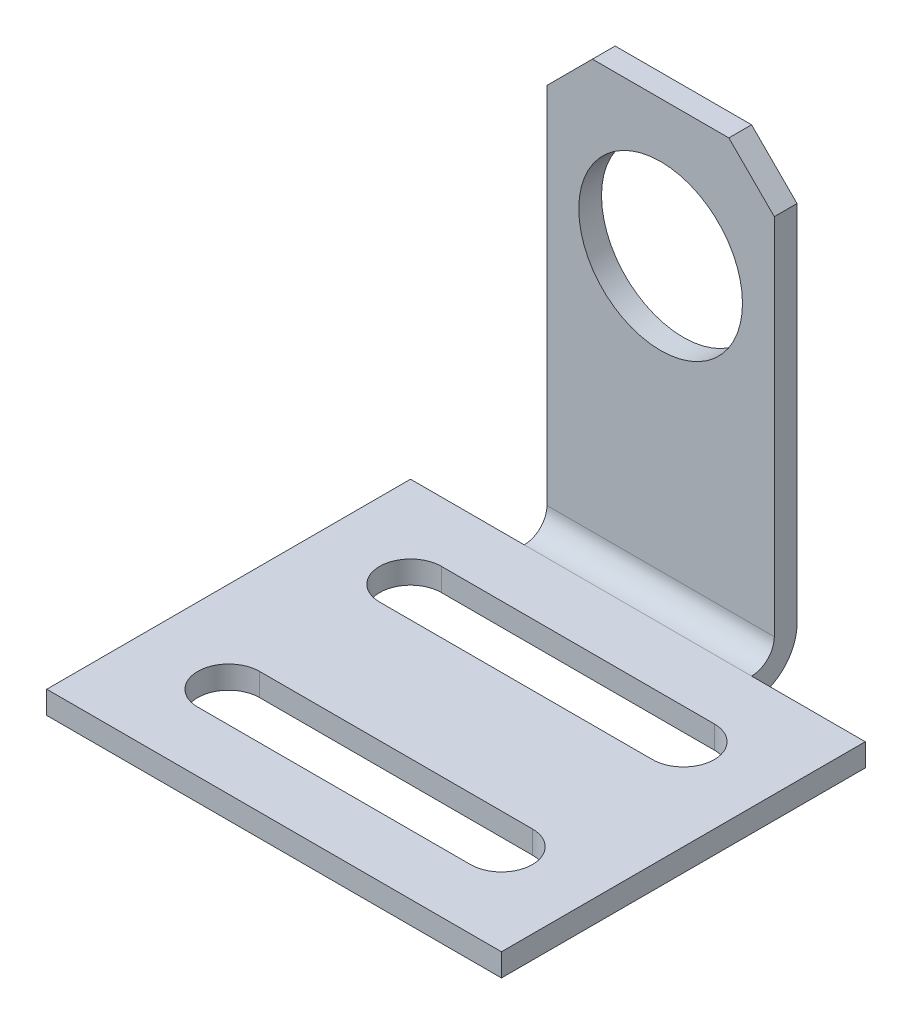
ISO-10303-21;
HEADER;
FILE_DESCRIPTION(('STEP AP214'),'2;1');
FILE_NAME('part.step','',(''),(''),'','','');
FILE_SCHEMA(('AUTOMOTIVE_DESIGN { 1 0 10303 214 1 1 1 1 }'));
ENDSEC;
DATA;
#1=APPLICATION_CONTEXT('core data for automotive mechanical design processes');
#2=APPLICATION_PROTOCOL_DEFINITION('international standard','automotive_design',2000,#1);
#3=PRODUCT_CONTEXT('',#1,'mechanical');
#4=PRODUCT('Part','Part','',(#3));
#5=PRODUCT_RELATED_PRODUCT_CATEGORY('part','',(#4));
#6=PRODUCT_DEFINITION_FORMATION('','',#4);
#7=PRODUCT_DEFINITION_CONTEXT('part definition',#1,'design');
#8=PRODUCT_DEFINITION('design','',#6,#7);
#9=PRODUCT_DEFINITION_SHAPE('','',#8);
#10=(LENGTH_UNIT() NAMED_UNIT(*) SI_UNIT(.MILLI.,.METRE.));
#11=(NAMED_UNIT(*) PLANE_ANGLE_UNIT() SI_UNIT($,.RADIAN.));
#12=(NAMED_UNIT(*) SI_UNIT($,.STERADIAN.) SOLID_ANGLE_UNIT());
#13=UNCERTAINTY_MEASURE_WITH_UNIT(LENGTH_MEASURE(1.E-05),#10,'distance_accuracy_value','');
#14=(GEOMETRIC_REPRESENTATION_CONTEXT(3) GLOBAL_UNCERTAINTY_ASSIGNED_CONTEXT((#13)) GLOBAL_UNIT_ASSIGNED_CONTEXT((#10,
#11,#12)) REPRESENTATION_CONTEXT('',''));
#15=CARTESIAN_POINT('',(0.,0.,0.));
#16=DIRECTION('',(0.,0.,1.));
#17=DIRECTION('',(1.,0.,0.));
#18=AXIS2_PLACEMENT_3D('',#15,#16,#17);
#19=CARTESIAN_POINT('',(25.,5.,-42.5));
#20=DIRECTION('',(1.,0.,0.));
#21=DIRECTION('',(0.,0.,-1.));
#22=AXIS2_PLACEMENT_3D('',#19,#20,#21);
#23=PLANE('',#22);
#24=DIRECTION('',(0.,0.,-1.));
#25=VECTOR('',#24,1.);
#26=CARTESIAN_POINT('',(25.,0.,-1.66533453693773E-13));
#27=LINE('',#26,#25);
#28=CARTESIAN_POINT('',(25.,0.,-1.66533453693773E-13));
#29=VERTEX_POINT('',#28);
#30=CARTESIAN_POINT('',(25.,0.,-40.));
#31=VERTEX_POINT('',#30);
#32=EDGE_CURVE('E413',#29,#31,#27,.T.);
#33=ORIENTED_EDGE('',*,*,#32,.T.);
#34=DIRECTION('',(0.,1.,0.));
#35=VECTOR('',#34,1.);
#36=CARTESIAN_POINT('',(25.,0.,-40.));
#37=LINE('',#36,#35);
#38=CARTESIAN_POINT('',(25.,2.50000000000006,-40.));
#39=VERTEX_POINT('',#38);
#40=EDGE_CURVE('E228',#31,#39,#37,.T.);
#41=ORIENTED_EDGE('',*,*,#40,.T.);
#42=DIRECTION('',(0.,0.,-1.));
#43=VECTOR('',#42,1.);
#44=CARTESIAN_POINT('',(25.,2.49999999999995,-1.66533453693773E-13));
#45=LINE('',#44,#43);
#46=CARTESIAN_POINT('',(25.,2.49999999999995,-1.66533453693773E-13));
#47=VERTEX_POINT('',#46);
#48=EDGE_CURVE('E404',#47,#39,#45,.T.);
#49=ORIENTED_EDGE('',*,*,#48,.F.);
#50=DIRECTION('',(0.,1.,0.));
#51=VECTOR('',#50,1.);
#52=CARTESIAN_POINT('',(25.,0.,-1.66533453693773E-13));
#53=LINE('',#52,#51);
#54=EDGE_CURVE('E411',#29,#47,#53,.T.);
#55=ORIENTED_EDGE('',*,*,#54,.F.);
#56=EDGE_LOOP('',(#33,#41,#49,#55));
#57=FACE_BOUND('',#56,.T.);
#58=ADVANCED_FACE('F44',(#57),#23,.T.);
#59=CARTESIAN_POINT('',(-25.,0.,-45.));
#60=DIRECTION('',(0.,0.,-1.));
#61=DIRECTION('',(-1.,0.,0.));
#62=AXIS2_PLACEMENT_3D('',#59,#60,#61);
#63=PLANE('',#62);
#64=DIRECTION('',(1.,0.,0.));
#65=VECTOR('',#64,1.);
#66=CARTESIAN_POINT('',(-25.,50.,-45.));
#67=LINE('',#66,#65);
#68=CARTESIAN_POINT('',(-7.49999999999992,50.,-45.));
#69=VERTEX_POINT('',#68);
#70=CARTESIAN_POINT('',(7.50000000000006,50.,-45.));
#71=VERTEX_POINT('',#70);
#72=EDGE_CURVE('E248',#69,#71,#67,.T.);
#73=ORIENTED_EDGE('',*,*,#72,.T.);
#74=DIRECTION('',(-0.707106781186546,0.707106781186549,0.));
#75=VECTOR('',#74,1.);
#76=CARTESIAN_POINT('',(16.25,41.2499999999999,-45.));
#77=LINE('',#76,#75);
#78=CARTESIAN_POINT('',(12.5,45.,-45.));
#79=VERTEX_POINT('',#78);
#80=EDGE_CURVE('E300',#71,#79,#77,.F.);
#81=ORIENTED_EDGE('',*,*,#80,.T.);
#82=DIRECTION('',(0.,1.,0.));
#83=VECTOR('',#82,1.);
#84=CARTESIAN_POINT('',(12.5000000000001,50.,-45.));
#85=LINE('',#84,#83);
#86=CARTESIAN_POINT('',(12.5,5.,-45.));
#87=VERTEX_POINT('',#86);
#88=EDGE_CURVE('E194',#87,#79,#85,.T.);
#89=ORIENTED_EDGE('',*,*,#88,.F.);
#90=DIRECTION('',(1.,0.,0.));
#91=VECTOR('',#90,1.);
#92=CARTESIAN_POINT('',(-25.,5.,-45.));
#93=LINE('',#92,#91);
#94=CARTESIAN_POINT('',(-12.5,5.,-45.));
#95=VERTEX_POINT('',#94);
#96=EDGE_CURVE('E224',#95,#87,#93,.T.);
#97=ORIENTED_EDGE('',*,*,#96,.F.);
#98=DIRECTION('',(0.,-1.,0.));
#99=VECTOR('',#98,1.);
#100=CARTESIAN_POINT('',(-12.5,0.,-45.));
#101=LINE('',#100,#99);
#102=CARTESIAN_POINT('',(-12.5,44.9999999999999,-45.));
#103=VERTEX_POINT('',#102);
#104=EDGE_CURVE('E189',#103,#95,#101,.T.);
#105=ORIENTED_EDGE('',*,*,#104,.F.);
#106=DIRECTION('',(-0.707106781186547,-0.707106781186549,0.));
#107=VECTOR('',#106,1.);
#108=CARTESIAN_POINT('',(-41.25,16.2499999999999,-45.));
#109=LINE('',#108,#107);
#110=EDGE_CURVE('E297',#103,#69,#109,.F.);
#111=ORIENTED_EDGE('',*,*,#110,.T.);
#112=EDGE_LOOP('',(#73,#81,#89,#97,#105,#111));
#113=FACE_BOUND('',#112,.T.);
#114=CARTESIAN_POINT('',(0.,35.,-45.));
#115=DIRECTION('',(0.,0.,-1.));
#116=DIRECTION('',(-1.,0.,0.));
#117=AXIS2_PLACEMENT_3D('',#114,#115,#116);
#118=CIRCLE('',#117,9.);
#119=CARTESIAN_POINT('',(-9.,35.,-45.));
#120=VERTEX_POINT('',#119);
#121=EDGE_CURVE('E390',#120,#120,#118,.F.);
#122=ORIENTED_EDGE('',*,*,#121,.T.);
#123=EDGE_LOOP('',(#122));
#124=FACE_BOUND('',#123,.T.);
#125=ADVANCED_FACE('F320',(#113,#124),#63,.T.);
#126=CARTESIAN_POINT('',(-25.,5.,-40.));
#127=DIRECTION('',(1.,0.,0.));
#128=DIRECTION('',(0.,0.,-1.));
#129=AXIS2_PLACEMENT_3D('',#126,#127,#128);
#130=CYLINDRICAL_SURFACE('',#129,5.);
#131=CARTESIAN_POINT('',(-12.5,5.,-40.));
#132=DIRECTION('',(1.,0.,0.));
#133=DIRECTION('',(0.,0.,-1.));
#134=AXIS2_PLACEMENT_3D('',#131,#132,#133);
#135=CIRCLE('',#134,5.);
#136=CARTESIAN_POINT('',(-12.5,0.,-40.));
#137=VERTEX_POINT('',#136);
#138=EDGE_CURVE('E182',#95,#137,#135,.F.);
#139=ORIENTED_EDGE('',*,*,#138,.F.);
#140=ORIENTED_EDGE('',*,*,#96,.T.);
#141=CARTESIAN_POINT('',(12.5,5.,-40.));
#142=DIRECTION('',(-1.,0.,0.));
#143=DIRECTION('',(0.,0.,1.));
#144=AXIS2_PLACEMENT_3D('',#141,#142,#143);
#145=CIRCLE('',#144,5.);
#146=CARTESIAN_POINT('',(12.5,0.,-40.));
#147=VERTEX_POINT('',#146);
#148=EDGE_CURVE('E211',#147,#87,#145,.F.);
#149=ORIENTED_EDGE('',*,*,#148,.F.);
#150=DIRECTION('',(1.,0.,0.));
#151=VECTOR('',#150,1.);
#152=CARTESIAN_POINT('',(-25.,0.,-40.));
#153=LINE('',#152,#151);
#154=EDGE_CURVE('E208',#137,#147,#153,.T.);
#155=ORIENTED_EDGE('',*,*,#154,.F.);
#156=EDGE_LOOP('',(#139,#140,#149,#155));
#157=FACE_BOUND('',#156,.T.);
#158=ADVANCED_FACE('F209',(#157),#130,.T.);
#159=CARTESIAN_POINT('',(-25.,0.,0.));
#160=DIRECTION('',(0.,-1.,0.));
#161=DIRECTION('',(0.,0.,-1.));
#162=AXIS2_PLACEMENT_3D('',#159,#160,#161);
#163=PLANE('',#162);
#164=CARTESIAN_POINT('',(15.,0.,-30.));
#165=DIRECTION('',(0.,-1.,0.));
#166=DIRECTION('',(0.,0.,1.));
#167=AXIS2_PLACEMENT_3D('',#164,#165,#166);
#168=CIRCLE('',#167,3.4);
#169=CARTESIAN_POINT('',(15.,0.,-33.4));
#170=VERTEX_POINT('',#169);
#171=CARTESIAN_POINT('',(15.,0.,-26.6));
#172=VERTEX_POINT('',#171);
#173=EDGE_CURVE('E344',#170,#172,#168,.T.);
#174=ORIENTED_EDGE('',*,*,#173,.F.);
#175=DIRECTION('',(1.,0.,0.));
#176=VECTOR('',#175,1.);
#177=CARTESIAN_POINT('',(15.,0.,-33.4));
#178=LINE('',#177,#176);
#179=CARTESIAN_POINT('',(-15.,0.,-33.4));
#180=VERTEX_POINT('',#179);
#181=EDGE_CURVE('E355',#180,#170,#178,.T.);
#182=ORIENTED_EDGE('',*,*,#181,.F.);
#183=CARTESIAN_POINT('',(-15.,0.,-30.0000000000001));
#184=DIRECTION('',(0.,-1.,0.));
#185=DIRECTION('',(0.,0.,-1.));
#186=AXIS2_PLACEMENT_3D('',#183,#184,#185);
#187=CIRCLE('',#186,3.4);
#188=CARTESIAN_POINT('',(-15.,0.,-26.6));
#189=VERTEX_POINT('',#188);
#190=EDGE_CURVE('E351',#189,#180,#187,.T.);
#191=ORIENTED_EDGE('',*,*,#190,.F.);
#192=DIRECTION('',(-1.,0.,0.));
#193=VECTOR('',#192,1.);
#194=CARTESIAN_POINT('',(15.,0.,-26.6));
#195=LINE('',#194,#193);
#196=EDGE_CURVE('E347',#172,#189,#195,.T.);
#197=ORIENTED_EDGE('',*,*,#196,.F.);
#198=EDGE_LOOP('',(#174,#182,#191,#197));
#199=FACE_BOUND('',#198,.T.);
#200=CARTESIAN_POINT('',(15.,0.,-10.0000000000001));
#201=DIRECTION('',(0.,-1.,0.));
#202=DIRECTION('',(0.,0.,1.));
#203=AXIS2_PLACEMENT_3D('',#200,#201,#202);
#204=CIRCLE('',#203,3.4);
#205=CARTESIAN_POINT('',(15.,0.,-13.4));
#206=VERTEX_POINT('',#205);
#207=CARTESIAN_POINT('',(15.,0.,-6.59999999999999));
#208=VERTEX_POINT('',#207);
#209=EDGE_CURVE('E363',#206,#208,#204,.T.);
#210=ORIENTED_EDGE('',*,*,#209,.F.);
#211=DIRECTION('',(1.,0.,0.));
#212=VECTOR('',#211,1.);
#213=CARTESIAN_POINT('',(15.,0.,-13.4));
#214=LINE('',#213,#212);
#215=CARTESIAN_POINT('',(-15.,0.,-13.4));
#216=VERTEX_POINT('',#215);
#217=EDGE_CURVE('E382',#216,#206,#214,.T.);
#218=ORIENTED_EDGE('',*,*,#217,.F.);
#219=CARTESIAN_POINT('',(-15.,0.,-10.0000000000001));
#220=DIRECTION('',(0.,-1.,0.));
#221=DIRECTION('',(0.,0.,-1.));
#222=AXIS2_PLACEMENT_3D('',#219,#220,#221);
#223=CIRCLE('',#222,3.4);
#224=CARTESIAN_POINT('',(-15.,0.,-6.59999999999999));
#225=VERTEX_POINT('',#224);
#226=EDGE_CURVE('E378',#225,#216,#223,.T.);
#227=ORIENTED_EDGE('',*,*,#226,.F.);
#228=DIRECTION('',(-1.,0.,0.));
#229=VECTOR('',#228,1.);
#230=CARTESIAN_POINT('',(15.,0.,-6.59999999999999));
#231=LINE('',#230,#229);
#232=EDGE_CURVE('E374',#208,#225,#231,.T.);
#233=ORIENTED_EDGE('',*,*,#232,.F.);
#234=EDGE_LOOP('',(#210,#218,#227,#233));
#235=FACE_BOUND('',#234,.T.);
#236=ORIENTED_EDGE('',*,*,#32,.F.);
#237=DIRECTION('',(1.,0.,0.));
#238=VECTOR('',#237,1.);
#239=CARTESIAN_POINT('',(-25.,0.,0.));
#240=LINE('',#239,#238);
#241=CARTESIAN_POINT('',(-25.,0.,0.));
#242=VERTEX_POINT('',#241);
#243=EDGE_CURVE('E216',#242,#29,#240,.T.);
#244=ORIENTED_EDGE('',*,*,#243,.F.);
#245=DIRECTION('',(0.,0.,-1.));
#246=VECTOR('',#245,1.);
#247=CARTESIAN_POINT('',(-25.,0.,0.));
#248=LINE('',#247,#246);
#249=CARTESIAN_POINT('',(-25.,0.,-40.));
#250=VERTEX_POINT('',#249);
#251=EDGE_CURVE('E222',#242,#250,#248,.T.);
#252=ORIENTED_EDGE('',*,*,#251,.T.);
#253=EDGE_CURVE('E200',#250,#137,#153,.T.);
#254=ORIENTED_EDGE('',*,*,#253,.T.);
#255=ORIENTED_EDGE('',*,*,#154,.T.);
#256=DIRECTION('',(-1.,0.,0.));
#257=VECTOR('',#256,1.);
#258=CARTESIAN_POINT('',(25.,0.,-40.));
#259=LINE('',#258,#257);
#260=EDGE_CURVE('E324',#31,#147,#259,.T.);
#261=ORIENTED_EDGE('',*,*,#260,.F.);
#262=EDGE_LOOP('',(#236,#244,#252,#254,#255,#261));
#263=FACE_BOUND('',#262,.T.);
#264=ADVANCED_FACE('F220',(#199,#235,#263),#163,.T.);
#265=CARTESIAN_POINT('',(-25.,0.,0.));
#266=DIRECTION('',(0.,0.,-1.));
#267=DIRECTION('',(-1.,0.,0.));
#268=AXIS2_PLACEMENT_3D('',#265,#266,#267);
#269=PLANE('',#268);
#270=ORIENTED_EDGE('',*,*,#54,.T.);
#271=DIRECTION('',(1.,0.,0.));
#272=VECTOR('',#271,1.);
#273=CARTESIAN_POINT('',(-25.,2.49999999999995,0.));
#274=LINE('',#273,#272);
#275=CARTESIAN_POINT('',(-25.,2.49999999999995,0.));
#276=VERTEX_POINT('',#275);
#277=EDGE_CURVE('E234',#276,#47,#274,.T.);
#278=ORIENTED_EDGE('',*,*,#277,.F.);
#279=DIRECTION('',(0.,1.,0.));
#280=VECTOR('',#279,1.);
#281=CARTESIAN_POINT('',(-25.,0.,0.));
#282=LINE('',#281,#280);
#283=EDGE_CURVE('E421',#242,#276,#282,.T.);
#284=ORIENTED_EDGE('',*,*,#283,.F.);
#285=ORIENTED_EDGE('',*,*,#243,.T.);
#286=EDGE_LOOP('',(#270,#278,#284,#285));
#287=FACE_BOUND('',#286,.T.);
#288=ADVANCED_FACE('F442',(#287),#269,.F.);
#289=CARTESIAN_POINT('',(-25.,2.49999999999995,0.));
#290=DIRECTION('',(0.,-1.,0.));
#291=DIRECTION('',(0.,0.,-1.));
#292=AXIS2_PLACEMENT_3D('',#289,#290,#291);
#293=PLANE('',#292);
#294=DIRECTION('',(1.,0.,0.));
#295=VECTOR('',#294,1.);
#296=CARTESIAN_POINT('',(-25.,2.49999999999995,-33.4));
#297=LINE('',#296,#295);
#298=CARTESIAN_POINT('',(-15.,2.49999999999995,-33.4));
#299=VERTEX_POINT('',#298);
#300=CARTESIAN_POINT('',(15.,2.49999999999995,-33.4));
#301=VERTEX_POINT('',#300);
#302=EDGE_CURVE('E281',#299,#301,#297,.T.);
#303=ORIENTED_EDGE('',*,*,#302,.T.);
#304=CARTESIAN_POINT('',(15.,2.49999999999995,-30.));
#305=DIRECTION('',(0.,-1.,0.));
#306=DIRECTION('',(0.,0.,-1.));
#307=AXIS2_PLACEMENT_3D('',#304,#305,#306);
#308=CIRCLE('',#307,3.4);
#309=CARTESIAN_POINT('',(15.,2.49999999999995,-26.6));
#310=VERTEX_POINT('',#309);
#311=EDGE_CURVE('E285',#301,#310,#308,.T.);
#312=ORIENTED_EDGE('',*,*,#311,.T.);
#313=DIRECTION('',(-1.,0.,0.));
#314=VECTOR('',#313,1.);
#315=CARTESIAN_POINT('',(-25.,2.49999999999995,-26.6));
#316=LINE('',#315,#314);
#317=CARTESIAN_POINT('',(-15.,2.49999999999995,-26.6));
#318=VERTEX_POINT('',#317);
#319=EDGE_CURVE('E273',#310,#318,#316,.T.);
#320=ORIENTED_EDGE('',*,*,#319,.T.);
#321=CARTESIAN_POINT('',(-15.,2.49999999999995,-30.0000000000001));
#322=DIRECTION('',(0.,-1.,0.));
#323=DIRECTION('',(0.,0.,-1.));
#324=AXIS2_PLACEMENT_3D('',#321,#322,#323);
#325=CIRCLE('',#324,3.4);
#326=EDGE_CURVE('E277',#318,#299,#325,.T.);
#327=ORIENTED_EDGE('',*,*,#326,.T.);
#328=EDGE_LOOP('',(#303,#312,#320,#327));
#329=FACE_BOUND('',#328,.T.);
#330=DIRECTION('',(1.,0.,0.));
#331=VECTOR('',#330,1.);
#332=CARTESIAN_POINT('',(-25.,2.49999999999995,-13.4));
#333=LINE('',#332,#331);
#334=CARTESIAN_POINT('',(-15.,2.49999999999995,-13.4));
#335=VERTEX_POINT('',#334);
#336=CARTESIAN_POINT('',(15.,2.49999999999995,-13.4));
#337=VERTEX_POINT('',#336);
#338=EDGE_CURVE('E266',#335,#337,#333,.T.);
#339=ORIENTED_EDGE('',*,*,#338,.T.);
#340=CARTESIAN_POINT('',(15.,2.49999999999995,-10.0000000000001));
#341=DIRECTION('',(0.,-1.,0.));
#342=DIRECTION('',(0.,0.,-1.));
#343=AXIS2_PLACEMENT_3D('',#340,#341,#342);
#344=CIRCLE('',#343,3.4);
#345=CARTESIAN_POINT('',(15.,2.49999999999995,-6.59999999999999));
#346=VERTEX_POINT('',#345);
#347=EDGE_CURVE('E269',#337,#346,#344,.T.);
#348=ORIENTED_EDGE('',*,*,#347,.T.);
#349=DIRECTION('',(-1.,0.,0.));
#350=VECTOR('',#349,1.);
#351=CARTESIAN_POINT('',(-25.,2.49999999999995,-6.59999999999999));
#352=LINE('',#351,#350);
#353=CARTESIAN_POINT('',(-15.,2.49999999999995,-6.59999999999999));
#354=VERTEX_POINT('',#353);
#355=EDGE_CURVE('E258',#346,#354,#352,.T.);
#356=ORIENTED_EDGE('',*,*,#355,.T.);
#357=CARTESIAN_POINT('',(-15.,2.49999999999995,-10.0000000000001));
#358=DIRECTION('',(0.,-1.,0.));
#359=DIRECTION('',(0.,0.,-1.));
#360=AXIS2_PLACEMENT_3D('',#357,#358,#359);
#361=CIRCLE('',#360,3.4);
#362=EDGE_CURVE('E262',#354,#335,#361,.T.);
#363=ORIENTED_EDGE('',*,*,#362,.T.);
#364=EDGE_LOOP('',(#339,#348,#356,#363));
#365=FACE_BOUND('',#364,.T.);
#366=ORIENTED_EDGE('',*,*,#48,.T.);
#367=DIRECTION('',(1.,0.,0.));
#368=VECTOR('',#367,1.);
#369=CARTESIAN_POINT('',(-25.,2.49999999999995,-40.));
#370=LINE('',#369,#368);
#371=CARTESIAN_POINT('',(12.5,2.50000000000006,-40.));
#372=VERTEX_POINT('',#371);
#373=EDGE_CURVE('E240',#372,#39,#370,.T.);
#374=ORIENTED_EDGE('',*,*,#373,.F.);
#375=CARTESIAN_POINT('',(-12.5,2.49999999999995,-40.));
#376=VERTEX_POINT('',#375);
#377=EDGE_CURVE('E239',#376,#372,#370,.T.);
#378=ORIENTED_EDGE('',*,*,#377,.F.);
#379=CARTESIAN_POINT('',(-25.,2.49999999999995,-40.));
#380=VERTEX_POINT('',#379);
#381=EDGE_CURVE('E203',#380,#376,#370,.T.);
#382=ORIENTED_EDGE('',*,*,#381,.F.);
#383=DIRECTION('',(0.,0.,-1.));
#384=VECTOR('',#383,1.);
#385=CARTESIAN_POINT('',(-25.,2.49999999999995,0.));
#386=LINE('',#385,#384);
#387=EDGE_CURVE('E417',#276,#380,#386,.T.);
#388=ORIENTED_EDGE('',*,*,#387,.F.);
#389=ORIENTED_EDGE('',*,*,#277,.T.);
#390=EDGE_LOOP('',(#366,#374,#378,#382,#388,#389));
#391=FACE_BOUND('',#390,.T.);
#392=ADVANCED_FACE('F437',(#329,#365,#391),#293,.F.);
#393=CARTESIAN_POINT('',(-25.,5.,-40.));
#394=DIRECTION('',(1.,0.,0.));
#395=DIRECTION('',(0.,0.,-1.));
#396=AXIS2_PLACEMENT_3D('',#393,#394,#395);
#397=CYLINDRICAL_SURFACE('',#396,2.5);
#398=DIRECTION('',(1.,0.,0.));
#399=VECTOR('',#398,1.);
#400=CARTESIAN_POINT('',(-25.,5.,-42.5));
#401=LINE('',#400,#399);
#402=CARTESIAN_POINT('',(-12.5,5.,-42.5));
#403=VERTEX_POINT('',#402);
#404=CARTESIAN_POINT('',(12.5,5.,-42.5));
#405=VERTEX_POINT('',#404);
#406=EDGE_CURVE('E241',#403,#405,#401,.T.);
#407=ORIENTED_EDGE('',*,*,#406,.F.);
#408=CARTESIAN_POINT('',(-12.5,5.,-40.));
#409=DIRECTION('',(1.,0.,0.));
#410=DIRECTION('',(0.,0.,-1.));
#411=AXIS2_PLACEMENT_3D('',#408,#409,#410);
#412=CIRCLE('',#411,2.5);
#413=EDGE_CURVE('E195',#403,#376,#412,.F.);
#414=ORIENTED_EDGE('',*,*,#413,.T.);
#415=ORIENTED_EDGE('',*,*,#377,.T.);
#416=CARTESIAN_POINT('',(12.5,5.,-40.));
#417=DIRECTION('',(-1.,0.,0.));
#418=DIRECTION('',(0.,0.,1.));
#419=AXIS2_PLACEMENT_3D('',#416,#417,#418);
#420=CIRCLE('',#419,2.5);
#421=EDGE_CURVE('E338',#372,#405,#420,.F.);
#422=ORIENTED_EDGE('',*,*,#421,.T.);
#423=EDGE_LOOP('',(#407,#414,#415,#422));
#424=FACE_BOUND('',#423,.T.);
#425=ADVANCED_FACE('F467',(#424),#397,.F.);
#426=CARTESIAN_POINT('',(-25.,0.,-42.5));
#427=DIRECTION('',(0.,0.,-1.));
#428=DIRECTION('',(-1.,0.,0.));
#429=AXIS2_PLACEMENT_3D('',#426,#427,#428);
#430=PLANE('',#429);
#431=CARTESIAN_POINT('',(0.,35.,-42.5));
#432=DIRECTION('',(0.,0.,1.));
#433=DIRECTION('',(1.,0.,0.));
#434=AXIS2_PLACEMENT_3D('',#431,#432,#433);
#435=CIRCLE('',#434,9.);
#436=CARTESIAN_POINT('',(9.,35.,-42.5));
#437=VERTEX_POINT('',#436);
#438=EDGE_CURVE('E400',#437,#437,#435,.T.);
#439=ORIENTED_EDGE('',*,*,#438,.F.);
#440=EDGE_LOOP('',(#439));
#441=FACE_BOUND('',#440,.T.);
#442=DIRECTION('',(0.,1.,0.));
#443=VECTOR('',#442,1.);
#444=CARTESIAN_POINT('',(12.5,0.,-42.5));
#445=LINE('',#444,#443);
#446=CARTESIAN_POINT('',(12.5,44.9999999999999,-42.5));
#447=VERTEX_POINT('',#446);
#448=EDGE_CURVE('E310',#405,#447,#445,.T.);
#449=ORIENTED_EDGE('',*,*,#448,.T.);
#450=DIRECTION('',(0.707106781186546,-0.707106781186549,0.));
#451=VECTOR('',#450,1.);
#452=CARTESIAN_POINT('',(7.49999999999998,50.,-42.5));
#453=LINE('',#452,#451);
#454=CARTESIAN_POINT('',(7.49999999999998,50.,-42.5));
#455=VERTEX_POINT('',#454);
#456=EDGE_CURVE('E52',#447,#455,#453,.F.);
#457=ORIENTED_EDGE('',*,*,#456,.T.);
#458=DIRECTION('',(1.,0.,0.));
#459=VECTOR('',#458,1.);
#460=CARTESIAN_POINT('',(-25.,50.,-42.5));
#461=LINE('',#460,#459);
#462=CARTESIAN_POINT('',(-7.50000000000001,50.,-42.5));
#463=VERTEX_POINT('',#462);
#464=EDGE_CURVE('E244',#463,#455,#461,.T.);
#465=ORIENTED_EDGE('',*,*,#464,.F.);
#466=DIRECTION('',(0.707106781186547,0.707106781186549,0.));
#467=VECTOR('',#466,1.);
#468=CARTESIAN_POINT('',(-7.50000000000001,50.,-42.5));
#469=LINE('',#468,#467);
#470=CARTESIAN_POINT('',(-12.5,45.,-42.5));
#471=VERTEX_POINT('',#470);
#472=EDGE_CURVE('E59',#463,#471,#469,.F.);
#473=ORIENTED_EDGE('',*,*,#472,.T.);
#474=DIRECTION('',(0.,-1.,0.));
#475=VECTOR('',#474,1.);
#476=CARTESIAN_POINT('',(-12.5,0.,-42.5));
#477=LINE('',#476,#475);
#478=EDGE_CURVE('E205',#471,#403,#477,.T.);
#479=ORIENTED_EDGE('',*,*,#478,.T.);
#480=ORIENTED_EDGE('',*,*,#406,.T.);
#481=EDGE_LOOP('',(#449,#457,#465,#473,#479,#480));
#482=FACE_BOUND('',#481,.T.);
#483=ADVANCED_FACE('F309',(#441,#482),#430,.F.);
#484=CARTESIAN_POINT('',(-25.,50.,-42.5));
#485=DIRECTION('',(0.,-1.,0.));
#486=DIRECTION('',(0.,0.,-1.));
#487=AXIS2_PLACEMENT_3D('',#484,#485,#486);
#488=PLANE('',#487);
#489=ORIENTED_EDGE('',*,*,#464,.T.);
#490=DIRECTION('',(0.,0.,-1.));
#491=VECTOR('',#490,1.);
#492=CARTESIAN_POINT('',(7.49999999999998,50.,-42.5));
#493=LINE('',#492,#491);
#494=EDGE_CURVE('E293',#455,#71,#493,.T.);
#495=ORIENTED_EDGE('',*,*,#494,.T.);
#496=ORIENTED_EDGE('',*,*,#72,.F.);
#497=DIRECTION('',(0.,0.,1.));
#498=VECTOR('',#497,1.);
#499=CARTESIAN_POINT('',(-7.50000000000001,50.,-42.5));
#500=LINE('',#499,#498);
#501=EDGE_CURVE('E289',#69,#463,#500,.T.);
#502=ORIENTED_EDGE('',*,*,#501,.T.);
#503=EDGE_LOOP('',(#489,#495,#496,#502));
#504=FACE_BOUND('',#503,.T.);
#505=ADVANCED_FACE('F314',(#504),#488,.F.);
#506=CARTESIAN_POINT('',(-25.,5.,-40.));
#507=DIRECTION('',(1.,0.,0.));
#508=DIRECTION('',(0.,0.,-1.));
#509=AXIS2_PLACEMENT_3D('',#506,#507,#508);
#510=PLANE('',#509);
#511=ORIENTED_EDGE('',*,*,#387,.T.);
#512=DIRECTION('',(0.,-1.,0.));
#513=VECTOR('',#512,1.);
#514=CARTESIAN_POINT('',(-25.,2.49999999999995,-40.));
#515=LINE('',#514,#513);
#516=EDGE_CURVE('E255',#380,#250,#515,.T.);
#517=ORIENTED_EDGE('',*,*,#516,.T.);
#518=ORIENTED_EDGE('',*,*,#251,.F.);
#519=ORIENTED_EDGE('',*,*,#283,.T.);
#520=EDGE_LOOP('',(#511,#517,#518,#519));
#521=FACE_BOUND('',#520,.T.);
#522=ADVANCED_FACE('F444',(#521),#510,.F.);
#523=CARTESIAN_POINT('',(0.,35.,-45.001));
#524=DIRECTION('',(0.,0.,1.));
#525=DIRECTION('',(1.,0.,0.));
#526=AXIS2_PLACEMENT_3D('',#523,#524,#525);
#527=CYLINDRICAL_SURFACE('',#526,9.);
#528=ORIENTED_EDGE('',*,*,#121,.F.);
#529=EDGE_LOOP('',(#528));
#530=FACE_BOUND('',#529,.T.);
#531=ORIENTED_EDGE('',*,*,#438,.T.);
#532=EDGE_LOOP('',(#531));
#533=FACE_BOUND('',#532,.T.);
#534=ADVANCED_FACE('F446',(#530,#533),#527,.F.);
#535=CARTESIAN_POINT('',(15.,5.,-10.0000000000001));
#536=DIRECTION('',(0.,-1.,0.));
#537=DIRECTION('',(0.,0.,-1.));
#538=AXIS2_PLACEMENT_3D('',#535,#536,#537);
#539=CYLINDRICAL_SURFACE('',#538,3.4);
#540=DIRECTION('',(0.,-1.,0.));
#541=VECTOR('',#540,1.);
#542=CARTESIAN_POINT('',(15.,5.,-13.4));
#543=LINE('',#542,#541);
#544=EDGE_CURVE('E387',#337,#206,#543,.T.);
#545=ORIENTED_EDGE('',*,*,#544,.T.);
#546=ORIENTED_EDGE('',*,*,#209,.T.);
#547=DIRECTION('',(0.,-1.,0.));
#548=VECTOR('',#547,1.);
#549=CARTESIAN_POINT('',(15.,5.,-6.59999999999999));
#550=LINE('',#549,#548);
#551=EDGE_CURVE('E386',#346,#208,#550,.T.);
#552=ORIENTED_EDGE('',*,*,#551,.F.);
#553=ORIENTED_EDGE('',*,*,#347,.F.);
#554=EDGE_LOOP('',(#545,#546,#552,#553));
#555=FACE_BOUND('',#554,.T.);
#556=ADVANCED_FACE('F452',(#555),#539,.F.);
#557=CARTESIAN_POINT('',(15.,5.,-13.4));
#558=DIRECTION('',(0.,0.,-1.));
#559=DIRECTION('',(-1.,0.,0.));
#560=AXIS2_PLACEMENT_3D('',#557,#558,#559);
#561=PLANE('',#560);
#562=DIRECTION('',(0.,-1.,0.));
#563=VECTOR('',#562,1.);
#564=CARTESIAN_POINT('',(-15.,5.,-13.4));
#565=LINE('',#564,#563);
#566=EDGE_CURVE('E391',#335,#216,#565,.T.);
#567=ORIENTED_EDGE('',*,*,#566,.T.);
#568=ORIENTED_EDGE('',*,*,#217,.T.);
#569=ORIENTED_EDGE('',*,*,#544,.F.);
#570=ORIENTED_EDGE('',*,*,#338,.F.);
#571=EDGE_LOOP('',(#567,#568,#569,#570));
#572=FACE_BOUND('',#571,.T.);
#573=ADVANCED_FACE('F496',(#572),#561,.F.);
#574=CARTESIAN_POINT('',(-15.,5.,-10.0000000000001));
#575=DIRECTION('',(0.,-1.,0.));
#576=DIRECTION('',(0.,0.,-1.));
#577=AXIS2_PLACEMENT_3D('',#574,#575,#576);
#578=CYLINDRICAL_SURFACE('',#577,3.4);
#579=DIRECTION('',(0.,-1.,0.));
#580=VECTOR('',#579,1.);
#581=CARTESIAN_POINT('',(-15.,5.,-6.59999999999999));
#582=LINE('',#581,#580);
#583=EDGE_CURVE('E394',#354,#225,#582,.T.);
#584=ORIENTED_EDGE('',*,*,#583,.T.);
#585=ORIENTED_EDGE('',*,*,#226,.T.);
#586=ORIENTED_EDGE('',*,*,#566,.F.);
#587=ORIENTED_EDGE('',*,*,#362,.F.);
#588=EDGE_LOOP('',(#584,#585,#586,#587));
#589=FACE_BOUND('',#588,.T.);
#590=ADVANCED_FACE('F499',(#589),#578,.F.);
#591=CARTESIAN_POINT('',(15.,5.,-6.59999999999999));
#592=DIRECTION('',(0.,0.,1.));
#593=DIRECTION('',(1.,0.,0.));
#594=AXIS2_PLACEMENT_3D('',#591,#592,#593);
#595=PLANE('',#594);
#596=ORIENTED_EDGE('',*,*,#551,.T.);
#597=ORIENTED_EDGE('',*,*,#232,.T.);
#598=ORIENTED_EDGE('',*,*,#583,.F.);
#599=ORIENTED_EDGE('',*,*,#355,.F.);
#600=EDGE_LOOP('',(#596,#597,#598,#599));
#601=FACE_BOUND('',#600,.T.);
#602=ADVANCED_FACE('F492',(#601),#595,.F.);
#603=CARTESIAN_POINT('',(15.,5.,-30.));
#604=DIRECTION('',(0.,-1.,0.));
#605=DIRECTION('',(0.,0.,-1.));
#606=AXIS2_PLACEMENT_3D('',#603,#604,#605);
#607=CYLINDRICAL_SURFACE('',#606,3.4);
#608=DIRECTION('',(0.,-1.,0.));
#609=VECTOR('',#608,1.);
#610=CARTESIAN_POINT('',(15.,5.,-33.4));
#611=LINE('',#610,#609);
#612=EDGE_CURVE('E360',#301,#170,#611,.T.);
#613=ORIENTED_EDGE('',*,*,#612,.T.);
#614=ORIENTED_EDGE('',*,*,#173,.T.);
#615=DIRECTION('',(0.,-1.,0.));
#616=VECTOR('',#615,1.);
#617=CARTESIAN_POINT('',(15.,5.,-26.6));
#618=LINE('',#617,#616);
#619=EDGE_CURVE('E359',#310,#172,#618,.T.);
#620=ORIENTED_EDGE('',*,*,#619,.F.);
#621=ORIENTED_EDGE('',*,*,#311,.F.);
#622=EDGE_LOOP('',(#613,#614,#620,#621));
#623=FACE_BOUND('',#622,.T.);
#624=ADVANCED_FACE('F506',(#623),#607,.F.);
#625=CARTESIAN_POINT('',(15.,5.,-33.4));
#626=DIRECTION('',(0.,0.,-1.));
#627=DIRECTION('',(-1.,0.,0.));
#628=AXIS2_PLACEMENT_3D('',#625,#626,#627);
#629=PLANE('',#628);
#630=DIRECTION('',(0.,-1.,0.));
#631=VECTOR('',#630,1.);
#632=CARTESIAN_POINT('',(-15.,5.,-33.4));
#633=LINE('',#632,#631);
#634=EDGE_CURVE('E364',#299,#180,#633,.T.);
#635=ORIENTED_EDGE('',*,*,#634,.T.);
#636=ORIENTED_EDGE('',*,*,#181,.T.);
#637=ORIENTED_EDGE('',*,*,#612,.F.);
#638=ORIENTED_EDGE('',*,*,#302,.F.);
#639=EDGE_LOOP('',(#635,#636,#637,#638));
#640=FACE_BOUND('',#639,.T.);
#641=ADVANCED_FACE('F536',(#640),#629,.F.);
#642=CARTESIAN_POINT('',(-15.,5.,-30.0000000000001));
#643=DIRECTION('',(0.,-1.,0.));
#644=DIRECTION('',(0.,0.,-1.));
#645=AXIS2_PLACEMENT_3D('',#642,#643,#644);
#646=CYLINDRICAL_SURFACE('',#645,3.4);
#647=DIRECTION('',(0.,-1.,0.));
#648=VECTOR('',#647,1.);
#649=CARTESIAN_POINT('',(-15.,5.,-26.6));
#650=LINE('',#649,#648);
#651=EDGE_CURVE('E366',#318,#189,#650,.T.);
#652=ORIENTED_EDGE('',*,*,#651,.T.);
#653=ORIENTED_EDGE('',*,*,#190,.T.);
#654=ORIENTED_EDGE('',*,*,#634,.F.);
#655=ORIENTED_EDGE('',*,*,#326,.F.);
#656=EDGE_LOOP('',(#652,#653,#654,#655));
#657=FACE_BOUND('',#656,.T.);
#658=ADVANCED_FACE('F544',(#657),#646,.F.);
#659=CARTESIAN_POINT('',(15.,5.,-26.6));
#660=DIRECTION('',(0.,0.,1.));
#661=DIRECTION('',(1.,0.,0.));
#662=AXIS2_PLACEMENT_3D('',#659,#660,#661);
#663=PLANE('',#662);
#664=ORIENTED_EDGE('',*,*,#619,.T.);
#665=ORIENTED_EDGE('',*,*,#196,.T.);
#666=ORIENTED_EDGE('',*,*,#651,.F.);
#667=ORIENTED_EDGE('',*,*,#319,.F.);
#668=EDGE_LOOP('',(#664,#665,#666,#667));
#669=FACE_BOUND('',#668,.T.);
#670=ADVANCED_FACE('F553',(#669),#663,.F.);
#671=CARTESIAN_POINT('',(25.,0.,-40.));
#672=DIRECTION('',(0.,0.,-1.));
#673=DIRECTION('',(-1.,0.,0.));
#674=AXIS2_PLACEMENT_3D('',#671,#672,#673);
#675=PLANE('',#674);
#676=ORIENTED_EDGE('',*,*,#373,.T.);
#677=ORIENTED_EDGE('',*,*,#40,.F.);
#678=ORIENTED_EDGE('',*,*,#260,.T.);
#679=DIRECTION('',(0.,1.,0.));
#680=VECTOR('',#679,1.);
#681=CARTESIAN_POINT('',(12.5,50.,-40.));
#682=LINE('',#681,#680);
#683=EDGE_CURVE('E329',#147,#372,#682,.T.);
#684=ORIENTED_EDGE('',*,*,#683,.T.);
#685=EDGE_LOOP('',(#676,#677,#678,#684));
#686=FACE_BOUND('',#685,.T.);
#687=ADVANCED_FACE('F432',(#686),#675,.T.);
#688=CARTESIAN_POINT('',(12.5,50.,-40.));
#689=DIRECTION('',(-1.,0.,0.));
#690=DIRECTION('',(0.,0.,1.));
#691=AXIS2_PLACEMENT_3D('',#688,#689,#690);
#692=PLANE('',#691);
#693=ORIENTED_EDGE('',*,*,#88,.T.);
#694=DIRECTION('',(0.,0.,1.));
#695=VECTOR('',#694,1.);
#696=CARTESIAN_POINT('',(12.5,45.,-40.));
#697=LINE('',#696,#695);
#698=EDGE_CURVE('E67',#79,#447,#697,.T.);
#699=ORIENTED_EDGE('',*,*,#698,.T.);
#700=ORIENTED_EDGE('',*,*,#448,.F.);
#701=ORIENTED_EDGE('',*,*,#421,.F.);
#702=ORIENTED_EDGE('',*,*,#683,.F.);
#703=ORIENTED_EDGE('',*,*,#148,.T.);
#704=EDGE_LOOP('',(#693,#699,#700,#701,#702,#703));
#705=FACE_BOUND('',#704,.T.);
#706=ADVANCED_FACE('F322',(#705),#692,.F.);
#707=CARTESIAN_POINT('',(-12.5,0.,-40.));
#708=DIRECTION('',(1.,0.,0.));
#709=DIRECTION('',(0.,0.,-1.));
#710=AXIS2_PLACEMENT_3D('',#707,#708,#709);
#711=PLANE('',#710);
#712=ORIENTED_EDGE('',*,*,#478,.F.);
#713=DIRECTION('',(0.,0.,-1.));
#714=VECTOR('',#713,1.);
#715=CARTESIAN_POINT('',(-12.5,45.,-40.));
#716=LINE('',#715,#714);
#717=EDGE_CURVE('E11',#471,#103,#716,.T.);
#718=ORIENTED_EDGE('',*,*,#717,.T.);
#719=ORIENTED_EDGE('',*,*,#104,.T.);
#720=ORIENTED_EDGE('',*,*,#138,.T.);
#721=DIRECTION('',(0.,-1.,0.));
#722=VECTOR('',#721,1.);
#723=CARTESIAN_POINT('',(-12.5,0.,-40.));
#724=LINE('',#723,#722);
#725=EDGE_CURVE('E186',#376,#137,#724,.T.);
#726=ORIENTED_EDGE('',*,*,#725,.F.);
#727=ORIENTED_EDGE('',*,*,#413,.F.);
#728=EDGE_LOOP('',(#712,#718,#719,#720,#726,#727));
#729=FACE_BOUND('',#728,.T.);
#730=ADVANCED_FACE('F184',(#729),#711,.F.);
#731=CARTESIAN_POINT('',(-25.,50.,-40.));
#732=DIRECTION('',(0.,0.,-1.));
#733=DIRECTION('',(-1.,0.,0.));
#734=AXIS2_PLACEMENT_3D('',#731,#732,#733);
#735=PLANE('',#734);
#736=ORIENTED_EDGE('',*,*,#381,.T.);
#737=ORIENTED_EDGE('',*,*,#725,.T.);
#738=ORIENTED_EDGE('',*,*,#253,.F.);
#739=ORIENTED_EDGE('',*,*,#516,.F.);
#740=EDGE_LOOP('',(#736,#737,#738,#739));
#741=FACE_BOUND('',#740,.T.);
#742=ADVANCED_FACE('F198',(#741),#735,.T.);
#743=CARTESIAN_POINT('',(7.49999999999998,50.,-42.5));
#744=DIRECTION('',(-0.707106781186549,-0.707106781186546,0.));
#745=DIRECTION('',(0.707106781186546,-0.707106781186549,0.));
#746=AXIS2_PLACEMENT_3D('',#743,#744,#745);
#747=PLANE('',#746);
#748=ORIENTED_EDGE('',*,*,#456,.F.);
#749=ORIENTED_EDGE('',*,*,#698,.F.);
#750=ORIENTED_EDGE('',*,*,#80,.F.);
#751=ORIENTED_EDGE('',*,*,#494,.F.);
#752=EDGE_LOOP('',(#748,#749,#750,#751));
#753=FACE_BOUND('',#752,.T.);
#754=ADVANCED_FACE('F317',(#753),#747,.F.);
#755=CARTESIAN_POINT('',(-7.50000000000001,50.,-42.5));
#756=DIRECTION('',(0.707106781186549,-0.707106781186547,0.));
#757=DIRECTION('',(0.707106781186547,0.707106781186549,0.));
#758=AXIS2_PLACEMENT_3D('',#755,#756,#757);
#759=PLANE('',#758);
#760=ORIENTED_EDGE('',*,*,#110,.F.);
#761=ORIENTED_EDGE('',*,*,#717,.F.);
#762=ORIENTED_EDGE('',*,*,#472,.F.);
#763=ORIENTED_EDGE('',*,*,#501,.F.);
#764=EDGE_LOOP('',(#760,#761,#762,#763));
#765=FACE_BOUND('',#764,.T.);
#766=ADVANCED_FACE('F598',(#765),#759,.F.);
#767=CLOSED_SHELL('',(#58,#125,#158,#264,#288,#392,#425,#483,#505,#522,#534,#556,#573,#590,#602,
#624,#641,#658,#670,#687,#706,#730,#742,#754,#766));
#768=MANIFOLD_SOLID_BREP('B2',#767);
#769=ADVANCED_BREP_SHAPE_REPRESENTATION('',(#18,#768),#14);
#770=SHAPE_DEFINITION_REPRESENTATION(#9,#769);
ENDSEC;
END-ISO-10303-21;
